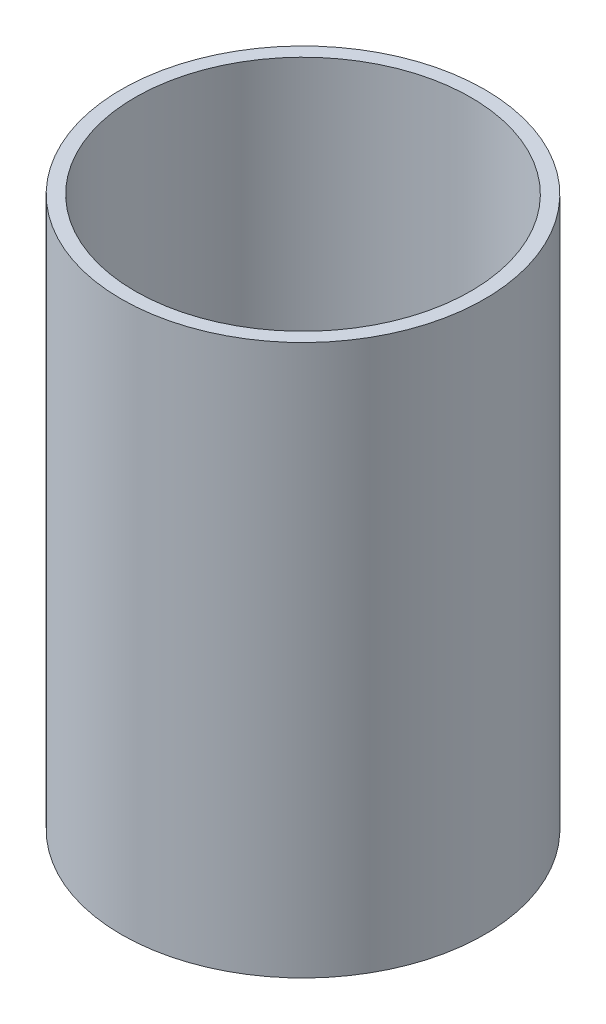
ISO-10303-21;
HEADER;
FILE_DESCRIPTION(('STEP AP214'),'2;1');
FILE_NAME('part.step','',(''),(''),'','','');
FILE_SCHEMA(('AUTOMOTIVE_DESIGN { 1 0 10303 214 1 1 1 1 }'));
ENDSEC;
DATA;
#1=APPLICATION_CONTEXT('core data for automotive mechanical design processes');
#2=APPLICATION_PROTOCOL_DEFINITION('international standard','automotive_design',2000,#1);
#3=PRODUCT_CONTEXT('',#1,'mechanical');
#4=PRODUCT('Part','Part','',(#3));
#5=PRODUCT_RELATED_PRODUCT_CATEGORY('part','',(#4));
#6=PRODUCT_DEFINITION_FORMATION('','',#4);
#7=PRODUCT_DEFINITION_CONTEXT('part definition',#1,'design');
#8=PRODUCT_DEFINITION('design','',#6,#7);
#9=PRODUCT_DEFINITION_SHAPE('','',#8);
#10=(LENGTH_UNIT() NAMED_UNIT(*) SI_UNIT(.MILLI.,.METRE.));
#11=(NAMED_UNIT(*) PLANE_ANGLE_UNIT() SI_UNIT($,.RADIAN.));
#12=(NAMED_UNIT(*) SI_UNIT($,.STERADIAN.) SOLID_ANGLE_UNIT());
#13=UNCERTAINTY_MEASURE_WITH_UNIT(LENGTH_MEASURE(1.E-05),#10,'distance_accuracy_value','');
#14=(GEOMETRIC_REPRESENTATION_CONTEXT(3) GLOBAL_UNCERTAINTY_ASSIGNED_CONTEXT((#13)) GLOBAL_UNIT_ASSIGNED_CONTEXT((#10,
#11,#12)) REPRESENTATION_CONTEXT('',''));
#15=CARTESIAN_POINT('',(0.,0.,0.));
#16=DIRECTION('',(0.,0.,1.));
#17=DIRECTION('',(1.,0.,0.));
#18=AXIS2_PLACEMENT_3D('',#15,#16,#17);
#19=CARTESIAN_POINT('',(0.,100.,0.));
#20=DIRECTION('',(0.,1.,0.));
#21=DIRECTION('',(0.,0.,1.));
#22=AXIS2_PLACEMENT_3D('',#19,#20,#21);
#23=PLANE('',#22);
#24=CARTESIAN_POINT('',(0.,100.,0.));
#25=DIRECTION('',(0.,1.,0.));
#26=DIRECTION('',(0.,0.,1.));
#27=AXIS2_PLACEMENT_3D('',#24,#25,#26);
#28=CIRCLE('',#27,33.);
#29=CARTESIAN_POINT('',(0.,100.,33.));
#30=VERTEX_POINT('',#29);
#31=EDGE_CURVE('E10',#30,#30,#28,.T.);
#32=ORIENTED_EDGE('',*,*,#31,.T.);
#33=EDGE_LOOP('',(#32));
#34=FACE_BOUND('',#33,.T.);
#35=CARTESIAN_POINT('',(0.,100.,0.));
#36=DIRECTION('',(0.,1.,0.));
#37=DIRECTION('',(0.,0.,1.));
#38=AXIS2_PLACEMENT_3D('',#35,#36,#37);
#39=CIRCLE('',#38,30.5);
#40=CARTESIAN_POINT('',(0.,100.,30.5));
#41=VERTEX_POINT('',#40);
#42=EDGE_CURVE('E42',#41,#41,#39,.T.);
#43=ORIENTED_EDGE('',*,*,#42,.F.);
#44=EDGE_LOOP('',(#43));
#45=FACE_BOUND('',#44,.T.);
#46=ADVANCED_FACE('F31',(#34,#45),#23,.T.);
#47=CARTESIAN_POINT('',(0.,0.,0.));
#48=DIRECTION('',(0.,1.,0.));
#49=DIRECTION('',(0.,0.,1.));
#50=AXIS2_PLACEMENT_3D('',#47,#48,#49);
#51=PLANE('',#50);
#52=CARTESIAN_POINT('',(0.,0.,0.));
#53=DIRECTION('',(0.,1.,0.));
#54=DIRECTION('',(0.,0.,1.));
#55=AXIS2_PLACEMENT_3D('',#52,#53,#54);
#56=CIRCLE('',#55,33.);
#57=CARTESIAN_POINT('',(0.,0.,33.));
#58=VERTEX_POINT('',#57);
#59=EDGE_CURVE('E35',#58,#58,#56,.T.);
#60=ORIENTED_EDGE('',*,*,#59,.F.);
#61=EDGE_LOOP('',(#60));
#62=FACE_BOUND('',#61,.T.);
#63=CARTESIAN_POINT('',(0.,0.,0.));
#64=DIRECTION('',(0.,1.,0.));
#65=DIRECTION('',(0.,0.,1.));
#66=AXIS2_PLACEMENT_3D('',#63,#64,#65);
#67=CIRCLE('',#66,30.5);
#68=CARTESIAN_POINT('',(0.,0.,30.5));
#69=VERTEX_POINT('',#68);
#70=EDGE_CURVE('E44',#69,#69,#67,.T.);
#71=ORIENTED_EDGE('',*,*,#70,.T.);
#72=EDGE_LOOP('',(#71));
#73=FACE_BOUND('',#72,.T.);
#74=ADVANCED_FACE('F54',(#62,#73),#51,.F.);
#75=CARTESIAN_POINT('',(0.,100.,0.));
#76=DIRECTION('',(0.,-1.,0.));
#77=DIRECTION('',(0.,0.,-1.));
#78=AXIS2_PLACEMENT_3D('',#75,#76,#77);
#79=CYLINDRICAL_SURFACE('',#78,33.);
#80=ORIENTED_EDGE('',*,*,#31,.F.);
#81=EDGE_LOOP('',(#80));
#82=FACE_BOUND('',#81,.T.);
#83=ORIENTED_EDGE('',*,*,#59,.T.);
#84=EDGE_LOOP('',(#83));
#85=FACE_BOUND('',#84,.T.);
#86=ADVANCED_FACE('F33',(#82,#85),#79,.T.);
#87=CARTESIAN_POINT('',(0.,100.,0.));
#88=DIRECTION('',(0.,-1.,0.));
#89=DIRECTION('',(0.,0.,-1.));
#90=AXIS2_PLACEMENT_3D('',#87,#88,#89);
#91=CYLINDRICAL_SURFACE('',#90,30.5);
#92=ORIENTED_EDGE('',*,*,#42,.T.);
#93=EDGE_LOOP('',(#92));
#94=FACE_BOUND('',#93,.T.);
#95=ORIENTED_EDGE('',*,*,#70,.F.);
#96=EDGE_LOOP('',(#95));
#97=FACE_BOUND('',#96,.T.);
#98=ADVANCED_FACE('F50',(#94,#97),#91,.F.);
#99=CLOSED_SHELL('',(#46,#74,#86,#98));
#100=MANIFOLD_SOLID_BREP('B2',#99);
#101=ADVANCED_BREP_SHAPE_REPRESENTATION('',(#18,#100),#14);
#102=SHAPE_DEFINITION_REPRESENTATION(#9,#101);
ENDSEC;
END-ISO-10303-21;
